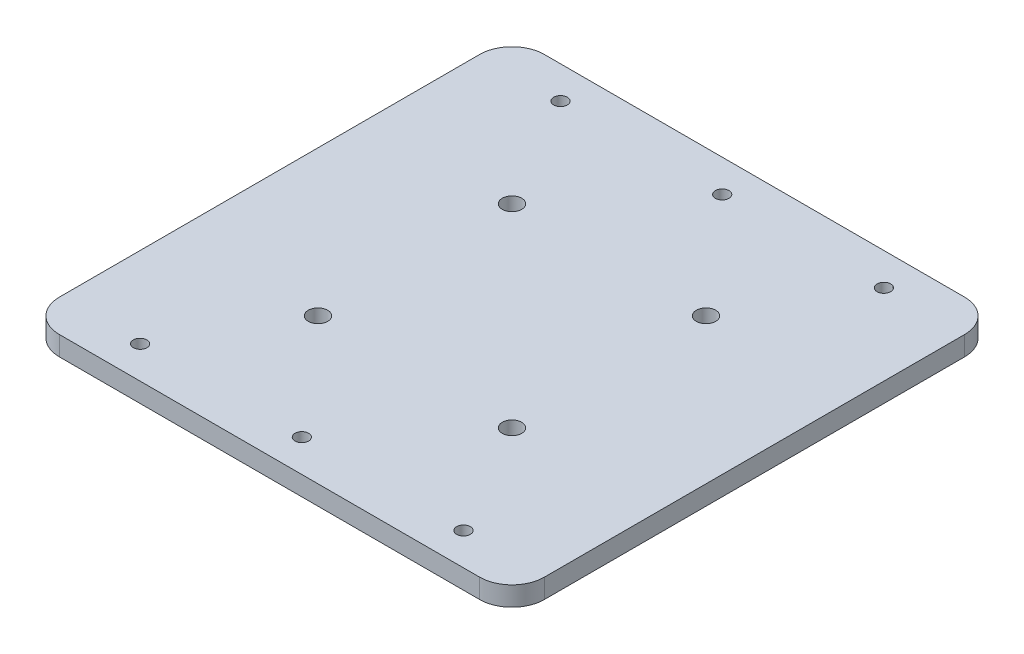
from build123d import *

# Parameters (mm, degrees)
SKETCH_1_W          = 150
SKETCH_1_H          = 150
EXTRUDE_1_DEPTH     = 6
SKETCH_2_R          = 3
CUT_EXTRUDE_1_DEPTH = 107.235587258
SKETCH_3_R          = 2
CUT_EXTRUDE_2_DEPTH = 6
SKETCH_5_R          = 4
CUT_EXTRUDE_3_DEPTH = 3
FILLET_1_R          = 10
SKETCH_6_R          = 25
CUT_EXTRUDE_4_DEPTH = 4
FILLET_2_R          = 2
SKETCH_7_R          = 2.1
CUT_EXTRUDE_5_DEPTH = 4


with BuildPart() as part:
    # Sketch 1 → Extrude 1 (new body)
    with BuildSketch(Plane(origin=(0, 0, 0), x_dir=(1, 0, 0), z_dir=(0, 1, 0))):
        Rectangle(SKETCH_1_W, SKETCH_1_H)
    extrude(amount=EXTRUDE_1_DEPTH)

    # Sketch 2 → Cut-Extrude 1 (cut, through all)
    with BuildSketch(Plane(origin=(0, 6, 0), x_dir=(1, 0, 0), z_dir=(0, 1, 0))):
        with Locations(Location((-30, 30, 0), (0, 0, 270))):
            Circle(SKETCH_2_R)
        with Locations(Location((30, 30, 0), (0, 0, 270))):
            Circle(SKETCH_2_R)
        with Locations(Location((30, -30, 0), (0, 0, 270))):
            Circle(SKETCH_2_R)
        with Locations(Location((-30, -30, 0), (0, 0, 270))):
            Circle(SKETCH_2_R)
    extrude(amount=-CUT_EXTRUDE_1_DEPTH, mode=Mode.SUBTRACT)

    # Sketch 3 → Cut-Extrude 2 (cut)
    with BuildSketch(Plane.XZ):
        with Locations(Location((0, 65, 0), (0, 0, 270))):
            Circle(SKETCH_3_R)
        with Locations(Location((50, 65, 0), (0, 0, 270))):
            Circle(SKETCH_3_R)
        with Locations(Location((-50, 65, 0), (0, 0, 270))):
            Circle(SKETCH_3_R)
        with Locations(Location((-50, -65, 0), (0, 0, 90))):
            Circle(SKETCH_3_R)
        with Locations(Location((50, -65, 0), (0, 0, 90))):
            Circle(SKETCH_3_R)
        with Locations(Location((0, -65, 0), (0, 0, 90))):
            Circle(SKETCH_3_R)
    extrude(amount=-CUT_EXTRUDE_2_DEPTH, mode=Mode.SUBTRACT)

    # Sketch 5 → Cut-Extrude 3 (cut)
    with BuildSketch(Plane.XZ):
        with Locations(Location((-50, 65, 0), (0, 0, 270))):
            Circle(SKETCH_5_R)
        with Locations(Location((0, 65, 0), (0, 0, 270))):
            Circle(SKETCH_5_R)
        with Locations(Location((50, 65, 0), (0, 0, 270))):
            Circle(SKETCH_5_R)
        with Locations(Location((50, -65, 0), (0, 0, 90))):
            Circle(SKETCH_5_R)
        with Locations(Location((0, -65, 0), (0, 0, 90))):
            Circle(SKETCH_5_R)
        with Locations(Location((-50, -65, 0), (0, 0, 90))):
            Circle(SKETCH_5_R)
    extrude(amount=-CUT_EXTRUDE_3_DEPTH, mode=Mode.SUBTRACT)

    # Fillet 1
    fillet_1_edges = [part.edges().sort_by_distance(p)[0] for p in [
        (75, 3, 75),
        (-75, 3, 75),
        (-75, 3, -75),
        (75, 3, -75),
    ]]
    fillet(fillet_1_edges, radius=FILLET_1_R)

    # Sketch 6 → Cut-Extrude 4 (cut)
    with BuildSketch(Plane.XZ):
        with Locations(Location((0, 0, 0), (0, 0, 270))):
            Circle(SKETCH_6_R)
        with BuildLine():
            Line((-65, -30), (-65, 30))
            ThreePointArc((-65, 30), (-55, 40), (-45, 30))
            Line((-45, 30), (-45, -30))
            ThreePointArc((-45, -30), (-55, -40), (-65, -30))
        make_face()
        with BuildLine():
            Line((-20, 55), (20, 55))
            ThreePointArc((20, 55), (30, 45), (20, 35))
            Line((20, 35), (-20, 35))
            ThreePointArc((-20, 35), (-30, 45), (-20, 55))
        make_face()
        with BuildLine():
            Line((65, -30), (65, 30))
            ThreePointArc((65, 30), (55, 40), (45, 30))
            Line((45, 30), (45, -30))
            ThreePointArc((45, -30), (55, -40), (65, -30))
        make_face()
        with BuildLine():
            Line((-20, -55), (20, -55))
            ThreePointArc((20, -55), (30, -45), (20, -35))
            Line((20, -35), (-20, -35))
            ThreePointArc((-20, -35), (-30, -45), (-20, -55))
        make_face()
    extrude(amount=-CUT_EXTRUDE_4_DEPTH, mode=Mode.SUBTRACT)

    # Fillet 2
    fillet_2_edges = [part.edges().sort_by_distance(p)[0] for p in [
        (-55, 0, -40),
        (-45, 0, 0),
        (-55, 0, 40),
        (-65, 0, 0),
        (-30, 0, 45),
        (0, 0, 35),
        (30, 0, 45),
        (0, 0, 55),
        (55, 0, -40),
        (65, 0, 0),
        (55, 0, 40),
        (45, 0, 0),
        (-30, 0, -45),
        (0, 0, -55),
        (30, 0, -45),
        (0, 0, -35),
        (0, 0, 25),
        (-50, 0, -69),
        (0, 0, -69),
        (50, 0, -69),
        (50, 0, 69),
        (0, 0, 69),
        (-50, 0, 69),
    ]]
    fillet(fillet_2_edges, radius=FILLET_2_R)

    # Sketch 7 → Cut-Extrude 5 (cut)
    with BuildSketch(Plane(origin=(0, 6, 0), x_dir=(1, 0, 0), z_dir=(0, 1, 0))):
        with Locations(Location((-50, 65, 0), (0, 0, 270))):
            Circle(SKETCH_7_R)
        with Locations(Location((0, 65, 0), (0, 0, 270))):
            Circle(SKETCH_7_R)
        with Locations(Location((50, 65, 0), (0, 0, 270))):
            Circle(SKETCH_7_R)
        with Locations(Location((50, -65, 0), (0, 0, 90))):
            Circle(SKETCH_7_R)
        with Locations(Location((0, -65, 0), (0, 0, 90))):
            Circle(SKETCH_7_R)
        with Locations(Location((-50, -65, 0), (0, 0, 90))):
            Circle(SKETCH_7_R)
    extrude(amount=-CUT_EXTRUDE_5_DEPTH, mode=Mode.SUBTRACT)


solid = part.part
